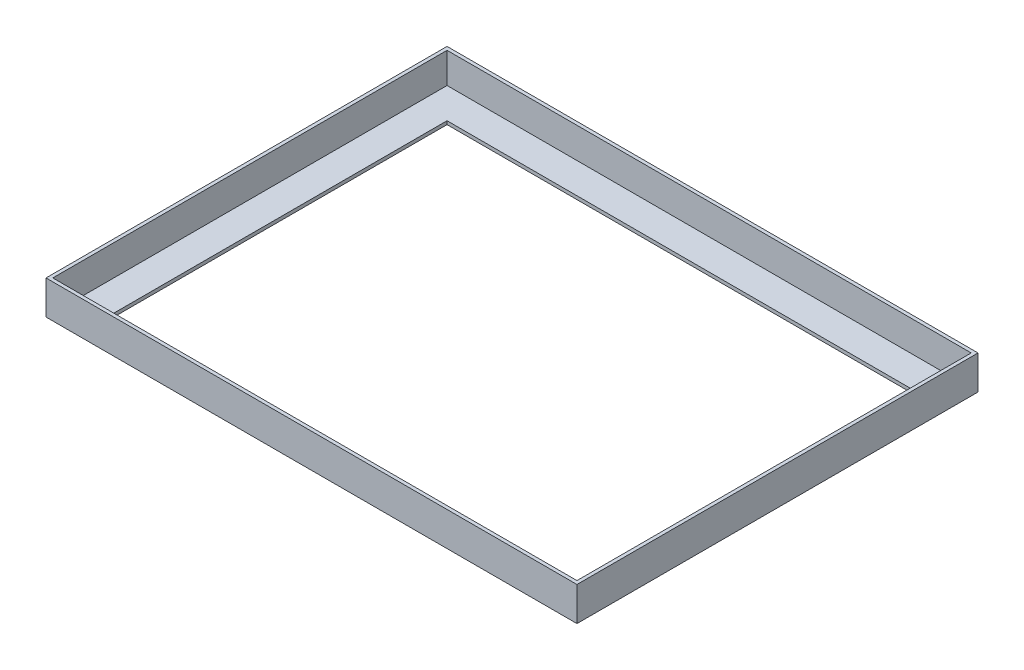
from build123d import *

# Parameters (mm, degrees)
SKETCH1_W           = 470
SKETCH1_H           = 355
SKETCH1_W_2         = 410
SKETCH1_H_2         = 295
BOSS_EXTRUDE1_DEPTH = 3
SKETCH2_W           = 470
SKETCH2_H           = 355
SKETCH2_W_2         = 464
SKETCH2_H_2         = 349
BOSS_EXTRUDE2_DEPTH = 27


with BuildPart() as part:
    # Sketch1 → Boss-Extrude1 (new body)
    with BuildSketch(Plane(origin=(0, 0, 0), x_dir=(1, 0, 0), z_dir=(0, 1, 0))):
        Rectangle(SKETCH1_W, SKETCH1_H)
        Rectangle(SKETCH1_W_2, SKETCH1_H_2, mode=Mode.SUBTRACT)
    extrude(amount=BOSS_EXTRUDE1_DEPTH)

    # Sketch2 → Boss-Extrude2 (add)
    with BuildSketch(Plane(origin=(0, 3, 0), x_dir=(1, 0, 0), z_dir=(0, 1, 0))):
        Rectangle(SKETCH2_W, SKETCH2_H)
        Rectangle(SKETCH2_W_2, SKETCH2_H_2, mode=Mode.SUBTRACT)
    extrude(amount=BOSS_EXTRUDE2_DEPTH)


solid = part.part
